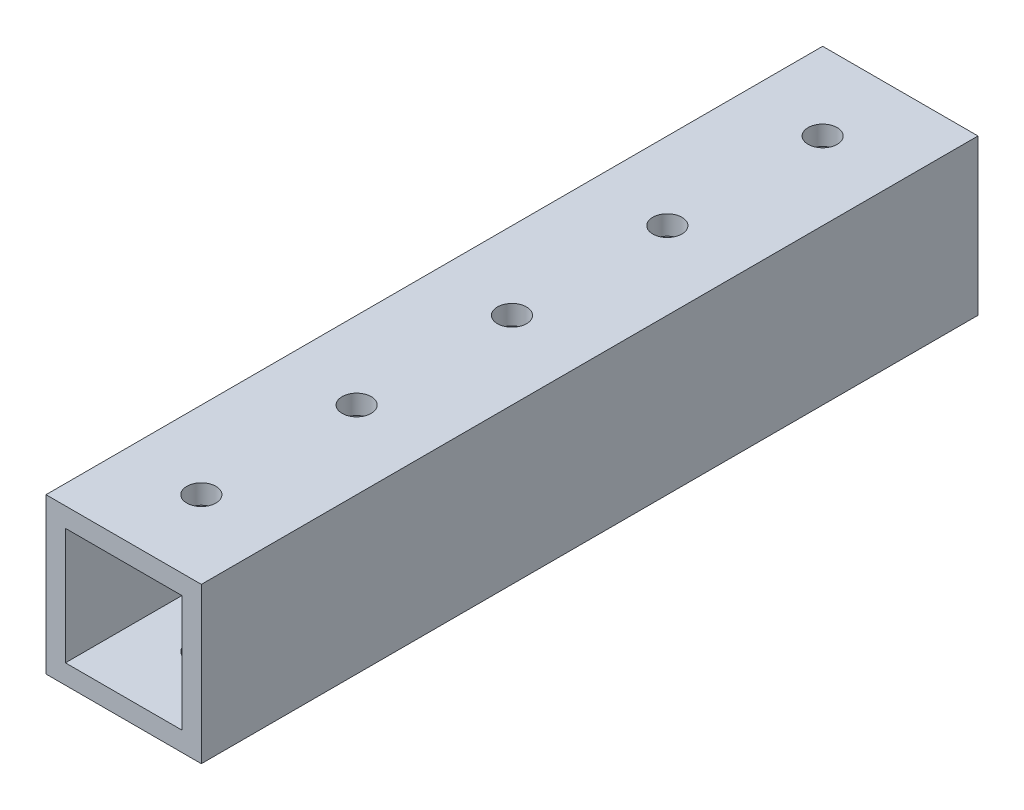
ISO-10303-21;
HEADER;
FILE_DESCRIPTION(('STEP AP214'),'2;1');
FILE_NAME('part.step','',(''),(''),'','','');
FILE_SCHEMA(('AUTOMOTIVE_DESIGN { 1 0 10303 214 1 1 1 1 }'));
ENDSEC;
DATA;
#1=APPLICATION_CONTEXT('core data for automotive mechanical design processes');
#2=APPLICATION_PROTOCOL_DEFINITION('international standard','automotive_design',2000,#1);
#3=PRODUCT_CONTEXT('',#1,'mechanical');
#4=PRODUCT('Part','Part','',(#3));
#5=PRODUCT_RELATED_PRODUCT_CATEGORY('part','',(#4));
#6=PRODUCT_DEFINITION_FORMATION('','',#4);
#7=PRODUCT_DEFINITION_CONTEXT('part definition',#1,'design');
#8=PRODUCT_DEFINITION('design','',#6,#7);
#9=PRODUCT_DEFINITION_SHAPE('','',#8);
#10=(LENGTH_UNIT() NAMED_UNIT(*) SI_UNIT(.MILLI.,.METRE.));
#11=(NAMED_UNIT(*) PLANE_ANGLE_UNIT() SI_UNIT($,.RADIAN.));
#12=(NAMED_UNIT(*) SI_UNIT($,.STERADIAN.) SOLID_ANGLE_UNIT());
#13=UNCERTAINTY_MEASURE_WITH_UNIT(LENGTH_MEASURE(1.E-05),#10,'distance_accuracy_value','');
#14=(GEOMETRIC_REPRESENTATION_CONTEXT(3) GLOBAL_UNCERTAINTY_ASSIGNED_CONTEXT((#13)) GLOBAL_UNIT_ASSIGNED_CONTEXT((#10,
#11,#12)) REPRESENTATION_CONTEXT('',''));
#15=CARTESIAN_POINT('',(0.,0.,0.));
#16=DIRECTION('',(0.,0.,1.));
#17=DIRECTION('',(1.,0.,0.));
#18=AXIS2_PLACEMENT_3D('',#15,#16,#17);
#19=CARTESIAN_POINT('',(-12.7,12.7,63.5));
#20=DIRECTION('',(0.,1.,0.));
#21=DIRECTION('',(0.,0.,1.));
#22=AXIS2_PLACEMENT_3D('',#19,#20,#21);
#23=PLANE('',#22);
#24=CARTESIAN_POINT('',(0.,12.7,50.8));
#25=DIRECTION('',(0.,1.,0.));
#26=DIRECTION('',(0.,0.,1.));
#27=AXIS2_PLACEMENT_3D('',#24,#25,#26);
#28=CIRCLE('',#27,2.38125);
#29=CARTESIAN_POINT('',(0.,12.7,53.18125));
#30=VERTEX_POINT('',#29);
#31=EDGE_CURVE('E322',#30,#30,#28,.T.);
#32=ORIENTED_EDGE('',*,*,#31,.F.);
#33=EDGE_LOOP('',(#32));
#34=FACE_BOUND('',#33,.T.);
#35=CARTESIAN_POINT('',(0.,12.7,25.4));
#36=DIRECTION('',(0.,1.,0.));
#37=DIRECTION('',(0.,0.,1.));
#38=AXIS2_PLACEMENT_3D('',#35,#36,#37);
#39=CIRCLE('',#38,2.38125);
#40=CARTESIAN_POINT('',(0.,12.7,27.78125));
#41=VERTEX_POINT('',#40);
#42=EDGE_CURVE('E209',#41,#41,#39,.T.);
#43=ORIENTED_EDGE('',*,*,#42,.F.);
#44=EDGE_LOOP('',(#43));
#45=FACE_BOUND('',#44,.T.);
#46=CARTESIAN_POINT('',(0.,12.7,0.));
#47=DIRECTION('',(0.,1.,0.));
#48=DIRECTION('',(0.,0.,1.));
#49=AXIS2_PLACEMENT_3D('',#46,#47,#48);
#50=CIRCLE('',#49,2.38125);
#51=CARTESIAN_POINT('',(0.,12.7,2.38125));
#52=VERTEX_POINT('',#51);
#53=EDGE_CURVE('E206',#52,#52,#50,.T.);
#54=ORIENTED_EDGE('',*,*,#53,.F.);
#55=EDGE_LOOP('',(#54));
#56=FACE_BOUND('',#55,.T.);
#57=CARTESIAN_POINT('',(0.,12.7,-25.4));
#58=DIRECTION('',(0.,1.,0.));
#59=DIRECTION('',(0.,0.,1.));
#60=AXIS2_PLACEMENT_3D('',#57,#58,#59);
#61=CIRCLE('',#60,2.38125);
#62=CARTESIAN_POINT('',(0.,12.7,-23.01875));
#63=VERTEX_POINT('',#62);
#64=EDGE_CURVE('E225',#63,#63,#61,.T.);
#65=ORIENTED_EDGE('',*,*,#64,.F.);
#66=EDGE_LOOP('',(#65));
#67=FACE_BOUND('',#66,.T.);
#68=CARTESIAN_POINT('',(0.,12.7,-50.8));
#69=DIRECTION('',(0.,1.,0.));
#70=DIRECTION('',(0.,0.,1.));
#71=AXIS2_PLACEMENT_3D('',#68,#69,#70);
#72=CIRCLE('',#71,2.38125);
#73=CARTESIAN_POINT('',(0.,12.7,-48.41875));
#74=VERTEX_POINT('',#73);
#75=EDGE_CURVE('E232',#74,#74,#72,.T.);
#76=ORIENTED_EDGE('',*,*,#75,.F.);
#77=EDGE_LOOP('',(#76));
#78=FACE_BOUND('',#77,.T.);
#79=DIRECTION('',(1.,0.,0.));
#80=VECTOR('',#79,1.);
#81=CARTESIAN_POINT('',(-12.7,12.7,-63.5));
#82=LINE('',#81,#80);
#83=CARTESIAN_POINT('',(-12.7,12.7,-63.5));
#84=VERTEX_POINT('',#83);
#85=CARTESIAN_POINT('',(12.7,12.7,-63.5));
#86=VERTEX_POINT('',#85);
#87=EDGE_CURVE('E156',#84,#86,#82,.T.);
#88=ORIENTED_EDGE('',*,*,#87,.F.);
#89=DIRECTION('',(0.,0.,-1.));
#90=VECTOR('',#89,1.);
#91=CARTESIAN_POINT('',(-12.7,12.7,63.5));
#92=LINE('',#91,#90);
#93=CARTESIAN_POINT('',(-12.7,12.7,63.5));
#94=VERTEX_POINT('',#93);
#95=EDGE_CURVE('E12',#94,#84,#92,.T.);
#96=ORIENTED_EDGE('',*,*,#95,.F.);
#97=DIRECTION('',(1.,0.,0.));
#98=VECTOR('',#97,1.);
#99=CARTESIAN_POINT('',(-12.7,12.7,63.5));
#100=LINE('',#99,#98);
#101=CARTESIAN_POINT('',(12.7,12.7,63.5));
#102=VERTEX_POINT('',#101);
#103=EDGE_CURVE('E160',#94,#102,#100,.T.);
#104=ORIENTED_EDGE('',*,*,#103,.T.);
#105=DIRECTION('',(0.,0.,-1.));
#106=VECTOR('',#105,1.);
#107=CARTESIAN_POINT('',(12.7,12.7,63.5));
#108=LINE('',#107,#106);
#109=EDGE_CURVE('E171',#102,#86,#108,.T.);
#110=ORIENTED_EDGE('',*,*,#109,.T.);
#111=EDGE_LOOP('',(#88,#96,#104,#110));
#112=FACE_BOUND('',#111,.T.);
#113=ADVANCED_FACE('F57',(#34,#45,#56,#67,#78,#112),#23,.T.);
#114=CARTESIAN_POINT('',(-12.7,12.7,63.5));
#115=DIRECTION('',(1.,0.,0.));
#116=DIRECTION('',(0.,1.,0.));
#117=AXIS2_PLACEMENT_3D('',#114,#115,#116);
#118=PLANE('',#117);
#119=DIRECTION('',(0.,-1.,0.));
#120=VECTOR('',#119,1.);
#121=CARTESIAN_POINT('',(-12.7,12.7,-63.5));
#122=LINE('',#121,#120);
#123=CARTESIAN_POINT('',(-12.7,-12.7,-63.5));
#124=VERTEX_POINT('',#123);
#125=EDGE_CURVE('E164',#84,#124,#122,.T.);
#126=ORIENTED_EDGE('',*,*,#125,.T.);
#127=DIRECTION('',(0.,0.,-1.));
#128=VECTOR('',#127,1.);
#129=CARTESIAN_POINT('',(-12.7,-12.7,63.5));
#130=LINE('',#129,#128);
#131=CARTESIAN_POINT('',(-12.7,-12.7,63.5));
#132=VERTEX_POINT('',#131);
#133=EDGE_CURVE('E65',#132,#124,#130,.T.);
#134=ORIENTED_EDGE('',*,*,#133,.F.);
#135=DIRECTION('',(0.,-1.,0.));
#136=VECTOR('',#135,1.);
#137=CARTESIAN_POINT('',(-12.7,12.7,63.5));
#138=LINE('',#137,#136);
#139=EDGE_CURVE('E169',#94,#132,#138,.T.);
#140=ORIENTED_EDGE('',*,*,#139,.F.);
#141=ORIENTED_EDGE('',*,*,#95,.T.);
#142=EDGE_LOOP('',(#126,#134,#140,#141));
#143=FACE_BOUND('',#142,.T.);
#144=ADVANCED_FACE('F242',(#143),#118,.F.);
#145=CARTESIAN_POINT('',(-12.7,-12.7,63.5));
#146=DIRECTION('',(0.,1.,0.));
#147=DIRECTION('',(0.,0.,1.));
#148=AXIS2_PLACEMENT_3D('',#145,#146,#147);
#149=PLANE('',#148);
#150=CARTESIAN_POINT('',(0.,-12.7,50.8));
#151=DIRECTION('',(0.,1.,0.));
#152=DIRECTION('',(0.,0.,1.));
#153=AXIS2_PLACEMENT_3D('',#150,#151,#152);
#154=CIRCLE('',#153,2.38125);
#155=CARTESIAN_POINT('',(0.,-12.7,53.18125));
#156=VERTEX_POINT('',#155);
#157=EDGE_CURVE('E321',#156,#156,#154,.T.);
#158=ORIENTED_EDGE('',*,*,#157,.T.);
#159=EDGE_LOOP('',(#158));
#160=FACE_BOUND('',#159,.T.);
#161=CARTESIAN_POINT('',(0.,-12.7,25.4));
#162=DIRECTION('',(0.,1.,0.));
#163=DIRECTION('',(0.,0.,1.));
#164=AXIS2_PLACEMENT_3D('',#161,#162,#163);
#165=CIRCLE('',#164,2.38125);
#166=CARTESIAN_POINT('',(0.,-12.7,27.78125));
#167=VERTEX_POINT('',#166);
#168=EDGE_CURVE('E202',#167,#167,#165,.T.);
#169=ORIENTED_EDGE('',*,*,#168,.T.);
#170=EDGE_LOOP('',(#169));
#171=FACE_BOUND('',#170,.T.);
#172=CARTESIAN_POINT('',(0.,-12.7,0.));
#173=DIRECTION('',(0.,1.,0.));
#174=DIRECTION('',(0.,0.,1.));
#175=AXIS2_PLACEMENT_3D('',#172,#173,#174);
#176=CIRCLE('',#175,2.38125);
#177=CARTESIAN_POINT('',(0.,-12.7,2.38125));
#178=VERTEX_POINT('',#177);
#179=EDGE_CURVE('E198',#178,#178,#176,.T.);
#180=ORIENTED_EDGE('',*,*,#179,.T.);
#181=EDGE_LOOP('',(#180));
#182=FACE_BOUND('',#181,.T.);
#183=CARTESIAN_POINT('',(0.,-12.7,-25.4));
#184=DIRECTION('',(0.,1.,0.));
#185=DIRECTION('',(0.,0.,1.));
#186=AXIS2_PLACEMENT_3D('',#183,#184,#185);
#187=CIRCLE('',#186,2.38125);
#188=CARTESIAN_POINT('',(0.,-12.7,-23.01875));
#189=VERTEX_POINT('',#188);
#190=EDGE_CURVE('E194',#189,#189,#187,.T.);
#191=ORIENTED_EDGE('',*,*,#190,.T.);
#192=EDGE_LOOP('',(#191));
#193=FACE_BOUND('',#192,.T.);
#194=CARTESIAN_POINT('',(0.,-12.7,-50.8));
#195=DIRECTION('',(0.,1.,0.));
#196=DIRECTION('',(0.,0.,1.));
#197=AXIS2_PLACEMENT_3D('',#194,#195,#196);
#198=CIRCLE('',#197,2.38125);
#199=CARTESIAN_POINT('',(0.,-12.7,-48.41875));
#200=VERTEX_POINT('',#199);
#201=EDGE_CURVE('E189',#200,#200,#198,.T.);
#202=ORIENTED_EDGE('',*,*,#201,.T.);
#203=EDGE_LOOP('',(#202));
#204=FACE_BOUND('',#203,.T.);
#205=DIRECTION('',(1.,0.,0.));
#206=VECTOR('',#205,1.);
#207=CARTESIAN_POINT('',(-12.7,-12.7,-63.5));
#208=LINE('',#207,#206);
#209=CARTESIAN_POINT('',(12.7,-12.7,-63.5));
#210=VERTEX_POINT('',#209);
#211=EDGE_CURVE('E177',#124,#210,#208,.T.);
#212=ORIENTED_EDGE('',*,*,#211,.T.);
#213=DIRECTION('',(0.,0.,-1.));
#214=VECTOR('',#213,1.);
#215=CARTESIAN_POINT('',(12.7,-12.7,63.5));
#216=LINE('',#215,#214);
#217=CARTESIAN_POINT('',(12.7,-12.7,63.5));
#218=VERTEX_POINT('',#217);
#219=EDGE_CURVE('E183',#218,#210,#216,.T.);
#220=ORIENTED_EDGE('',*,*,#219,.F.);
#221=DIRECTION('',(1.,0.,0.));
#222=VECTOR('',#221,1.);
#223=CARTESIAN_POINT('',(-12.7,-12.7,63.5));
#224=LINE('',#223,#222);
#225=EDGE_CURVE('E167',#132,#218,#224,.T.);
#226=ORIENTED_EDGE('',*,*,#225,.F.);
#227=ORIENTED_EDGE('',*,*,#133,.T.);
#228=EDGE_LOOP('',(#212,#220,#226,#227));
#229=FACE_BOUND('',#228,.T.);
#230=ADVANCED_FACE('F255',(#160,#171,#182,#193,#204,#229),#149,.F.);
#231=CARTESIAN_POINT('',(12.7,12.7,63.5));
#232=DIRECTION('',(1.,0.,0.));
#233=DIRECTION('',(0.,1.,0.));
#234=AXIS2_PLACEMENT_3D('',#231,#232,#233);
#235=PLANE('',#234);
#236=DIRECTION('',(0.,-1.,0.));
#237=VECTOR('',#236,1.);
#238=CARTESIAN_POINT('',(12.7,12.7,-63.5));
#239=LINE('',#238,#237);
#240=EDGE_CURVE('E174',#86,#210,#239,.T.);
#241=ORIENTED_EDGE('',*,*,#240,.F.);
#242=ORIENTED_EDGE('',*,*,#109,.F.);
#243=DIRECTION('',(0.,-1.,0.));
#244=VECTOR('',#243,1.);
#245=CARTESIAN_POINT('',(12.7,12.7,63.5));
#246=LINE('',#245,#244);
#247=EDGE_CURVE('E163',#102,#218,#246,.T.);
#248=ORIENTED_EDGE('',*,*,#247,.T.);
#249=ORIENTED_EDGE('',*,*,#219,.T.);
#250=EDGE_LOOP('',(#241,#242,#248,#249));
#251=FACE_BOUND('',#250,.T.);
#252=ADVANCED_FACE('F260',(#251),#235,.T.);
#253=CARTESIAN_POINT('',(0.,0.,63.5));
#254=DIRECTION('',(0.,0.,-1.));
#255=DIRECTION('',(-1.,0.,0.));
#256=AXIS2_PLACEMENT_3D('',#253,#254,#255);
#257=PLANE('',#256);
#258=DIRECTION('',(0.,-1.,0.));
#259=VECTOR('',#258,1.);
#260=CARTESIAN_POINT('',(-9.525,9.525,63.5));
#261=LINE('',#260,#259);
#262=CARTESIAN_POINT('',(-9.525,9.525,63.5));
#263=VERTEX_POINT('',#262);
#264=CARTESIAN_POINT('',(-9.52499999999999,-9.525,63.5));
#265=VERTEX_POINT('',#264);
#266=EDGE_CURVE('E127',#263,#265,#261,.T.);
#267=ORIENTED_EDGE('',*,*,#266,.F.);
#268=DIRECTION('',(1.,0.,0.));
#269=VECTOR('',#268,1.);
#270=CARTESIAN_POINT('',(-9.525,9.525,63.5));
#271=LINE('',#270,#269);
#272=CARTESIAN_POINT('',(9.52499999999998,9.525,63.5));
#273=VERTEX_POINT('',#272);
#274=EDGE_CURVE('E124',#263,#273,#271,.T.);
#275=ORIENTED_EDGE('',*,*,#274,.T.);
#276=DIRECTION('',(0.,-1.,0.));
#277=VECTOR('',#276,1.);
#278=CARTESIAN_POINT('',(9.52499999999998,9.525,63.5));
#279=LINE('',#278,#277);
#280=CARTESIAN_POINT('',(9.52499999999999,-9.52500000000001,63.5));
#281=VERTEX_POINT('',#280);
#282=EDGE_CURVE('E130',#273,#281,#279,.T.);
#283=ORIENTED_EDGE('',*,*,#282,.T.);
#284=DIRECTION('',(1.,0.,0.));
#285=VECTOR('',#284,1.);
#286=CARTESIAN_POINT('',(-9.52499999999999,-9.525,63.5));
#287=LINE('',#286,#285);
#288=EDGE_CURVE('E134',#265,#281,#287,.T.);
#289=ORIENTED_EDGE('',*,*,#288,.F.);
#290=EDGE_LOOP('',(#267,#275,#283,#289));
#291=FACE_BOUND('',#290,.T.);
#292=ORIENTED_EDGE('',*,*,#103,.F.);
#293=ORIENTED_EDGE('',*,*,#139,.T.);
#294=ORIENTED_EDGE('',*,*,#225,.T.);
#295=ORIENTED_EDGE('',*,*,#247,.F.);
#296=EDGE_LOOP('',(#292,#293,#294,#295));
#297=FACE_BOUND('',#296,.T.);
#298=ADVANCED_FACE('F136',(#291,#297),#257,.F.);
#299=CARTESIAN_POINT('',(0.,0.,-63.5));
#300=DIRECTION('',(0.,0.,-1.));
#301=DIRECTION('',(-1.,0.,0.));
#302=AXIS2_PLACEMENT_3D('',#299,#300,#301);
#303=PLANE('',#302);
#304=DIRECTION('',(1.,0.,0.));
#305=VECTOR('',#304,1.);
#306=CARTESIAN_POINT('',(-9.525,9.525,-63.5));
#307=LINE('',#306,#305);
#308=CARTESIAN_POINT('',(-9.525,9.525,-63.5));
#309=VERTEX_POINT('',#308);
#310=CARTESIAN_POINT('',(9.52499999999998,9.525,-63.5));
#311=VERTEX_POINT('',#310);
#312=EDGE_CURVE('E81',#309,#311,#307,.T.);
#313=ORIENTED_EDGE('',*,*,#312,.F.);
#314=DIRECTION('',(0.,-1.,0.));
#315=VECTOR('',#314,1.);
#316=CARTESIAN_POINT('',(-9.525,9.525,-63.5));
#317=LINE('',#316,#315);
#318=CARTESIAN_POINT('',(-9.52499999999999,-9.525,-63.5));
#319=VERTEX_POINT('',#318);
#320=EDGE_CURVE('E138',#309,#319,#317,.T.);
#321=ORIENTED_EDGE('',*,*,#320,.T.);
#322=DIRECTION('',(1.,0.,0.));
#323=VECTOR('',#322,1.);
#324=CARTESIAN_POINT('',(-9.52499999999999,-9.525,-63.5));
#325=LINE('',#324,#323);
#326=CARTESIAN_POINT('',(9.52499999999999,-9.52500000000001,-63.5));
#327=VERTEX_POINT('',#326);
#328=EDGE_CURVE('E141',#319,#327,#325,.T.);
#329=ORIENTED_EDGE('',*,*,#328,.T.);
#330=DIRECTION('',(0.,-1.,0.));
#331=VECTOR('',#330,1.);
#332=CARTESIAN_POINT('',(9.52499999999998,9.525,-63.5));
#333=LINE('',#332,#331);
#334=EDGE_CURVE('E150',#311,#327,#333,.T.);
#335=ORIENTED_EDGE('',*,*,#334,.F.);
#336=EDGE_LOOP('',(#313,#321,#329,#335));
#337=FACE_BOUND('',#336,.T.);
#338=ORIENTED_EDGE('',*,*,#87,.T.);
#339=ORIENTED_EDGE('',*,*,#240,.T.);
#340=ORIENTED_EDGE('',*,*,#211,.F.);
#341=ORIENTED_EDGE('',*,*,#125,.F.);
#342=EDGE_LOOP('',(#338,#339,#340,#341));
#343=FACE_BOUND('',#342,.T.);
#344=ADVANCED_FACE('F249',(#337,#343),#303,.T.);
#345=CARTESIAN_POINT('',(-9.525,9.525,63.5));
#346=DIRECTION('',(0.,1.,0.));
#347=DIRECTION('',(0.,0.,1.));
#348=AXIS2_PLACEMENT_3D('',#345,#346,#347);
#349=PLANE('',#348);
#350=CARTESIAN_POINT('',(0.,9.525,50.8));
#351=DIRECTION('',(0.,1.,0.));
#352=DIRECTION('',(0.,0.,1.));
#353=AXIS2_PLACEMENT_3D('',#350,#351,#352);
#354=CIRCLE('',#353,2.38125);
#355=CARTESIAN_POINT('',(0.,9.525,53.18125));
#356=VERTEX_POINT('',#355);
#357=EDGE_CURVE('E214',#356,#356,#354,.T.);
#358=ORIENTED_EDGE('',*,*,#357,.T.);
#359=EDGE_LOOP('',(#358));
#360=FACE_BOUND('',#359,.T.);
#361=CARTESIAN_POINT('',(0.,9.525,25.4));
#362=DIRECTION('',(0.,1.,0.));
#363=DIRECTION('',(0.,0.,1.));
#364=AXIS2_PLACEMENT_3D('',#361,#362,#363);
#365=CIRCLE('',#364,2.38125);
#366=CARTESIAN_POINT('',(0.,9.525,27.78125));
#367=VERTEX_POINT('',#366);
#368=EDGE_CURVE('E201',#367,#367,#365,.T.);
#369=ORIENTED_EDGE('',*,*,#368,.T.);
#370=EDGE_LOOP('',(#369));
#371=FACE_BOUND('',#370,.T.);
#372=CARTESIAN_POINT('',(0.,9.525,0.));
#373=DIRECTION('',(0.,1.,0.));
#374=DIRECTION('',(0.,0.,1.));
#375=AXIS2_PLACEMENT_3D('',#372,#373,#374);
#376=CIRCLE('',#375,2.38125);
#377=CARTESIAN_POINT('',(0.,9.525,2.38125));
#378=VERTEX_POINT('',#377);
#379=EDGE_CURVE('E197',#378,#378,#376,.T.);
#380=ORIENTED_EDGE('',*,*,#379,.T.);
#381=EDGE_LOOP('',(#380));
#382=FACE_BOUND('',#381,.T.);
#383=CARTESIAN_POINT('',(0.,9.525,-25.4));
#384=DIRECTION('',(0.,1.,0.));
#385=DIRECTION('',(0.,0.,1.));
#386=AXIS2_PLACEMENT_3D('',#383,#384,#385);
#387=CIRCLE('',#386,2.38125);
#388=CARTESIAN_POINT('',(0.,9.525,-23.01875));
#389=VERTEX_POINT('',#388);
#390=EDGE_CURVE('E193',#389,#389,#387,.T.);
#391=ORIENTED_EDGE('',*,*,#390,.T.);
#392=EDGE_LOOP('',(#391));
#393=FACE_BOUND('',#392,.T.);
#394=CARTESIAN_POINT('',(0.,9.525,-50.8));
#395=DIRECTION('',(0.,1.,0.));
#396=DIRECTION('',(0.,0.,1.));
#397=AXIS2_PLACEMENT_3D('',#394,#395,#396);
#398=CIRCLE('',#397,2.38125);
#399=CARTESIAN_POINT('',(0.,9.525,-48.41875));
#400=VERTEX_POINT('',#399);
#401=EDGE_CURVE('E144',#400,#400,#398,.T.);
#402=ORIENTED_EDGE('',*,*,#401,.T.);
#403=EDGE_LOOP('',(#402));
#404=FACE_BOUND('',#403,.T.);
#405=ORIENTED_EDGE('',*,*,#312,.T.);
#406=DIRECTION('',(0.,0.,-1.));
#407=VECTOR('',#406,1.);
#408=CARTESIAN_POINT('',(9.52499999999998,9.525,63.5));
#409=LINE('',#408,#407);
#410=EDGE_CURVE('E121',#273,#311,#409,.T.);
#411=ORIENTED_EDGE('',*,*,#410,.F.);
#412=ORIENTED_EDGE('',*,*,#274,.F.);
#413=DIRECTION('',(0.,0.,-1.));
#414=VECTOR('',#413,1.);
#415=CARTESIAN_POINT('',(-9.525,9.525,63.5));
#416=LINE('',#415,#414);
#417=EDGE_CURVE('E154',#263,#309,#416,.T.);
#418=ORIENTED_EDGE('',*,*,#417,.T.);
#419=EDGE_LOOP('',(#405,#411,#412,#418));
#420=FACE_BOUND('',#419,.T.);
#421=ADVANCED_FACE('F122',(#360,#371,#382,#393,#404,#420),#349,.F.);
#422=CARTESIAN_POINT('',(-9.525,9.525,63.5));
#423=DIRECTION('',(1.,0.,0.));
#424=DIRECTION('',(0.,1.,0.));
#425=AXIS2_PLACEMENT_3D('',#422,#423,#424);
#426=PLANE('',#425);
#427=ORIENTED_EDGE('',*,*,#320,.F.);
#428=ORIENTED_EDGE('',*,*,#417,.F.);
#429=ORIENTED_EDGE('',*,*,#266,.T.);
#430=DIRECTION('',(0.,0.,-1.));
#431=VECTOR('',#430,1.);
#432=CARTESIAN_POINT('',(-9.52499999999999,-9.525,63.5));
#433=LINE('',#432,#431);
#434=EDGE_CURVE('E157',#265,#319,#433,.T.);
#435=ORIENTED_EDGE('',*,*,#434,.T.);
#436=EDGE_LOOP('',(#427,#428,#429,#435));
#437=FACE_BOUND('',#436,.T.);
#438=ADVANCED_FACE('F277',(#437),#426,.T.);
#439=CARTESIAN_POINT('',(-9.52499999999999,-9.525,63.5));
#440=DIRECTION('',(0.,1.,0.));
#441=DIRECTION('',(-1.,0.,0.));
#442=AXIS2_PLACEMENT_3D('',#439,#440,#441);
#443=PLANE('',#442);
#444=CARTESIAN_POINT('',(0.,-9.525,50.8));
#445=DIRECTION('',(0.,1.,0.));
#446=DIRECTION('',(-1.,0.,0.));
#447=AXIS2_PLACEMENT_3D('',#444,#445,#446);
#448=CIRCLE('',#447,2.38125);
#449=CARTESIAN_POINT('',(-2.38124999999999,-9.525,50.8));
#450=VERTEX_POINT('',#449);
#451=EDGE_CURVE('E60',#450,#450,#448,.T.);
#452=ORIENTED_EDGE('',*,*,#451,.F.);
#453=EDGE_LOOP('',(#452));
#454=FACE_BOUND('',#453,.T.);
#455=CARTESIAN_POINT('',(0.,-9.525,25.4));
#456=DIRECTION('',(0.,1.,0.));
#457=DIRECTION('',(-1.,0.,0.));
#458=AXIS2_PLACEMENT_3D('',#455,#456,#457);
#459=CIRCLE('',#458,2.38125);
#460=CARTESIAN_POINT('',(-2.38124999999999,-9.525,25.4));
#461=VERTEX_POINT('',#460);
#462=EDGE_CURVE('E199',#461,#461,#459,.T.);
#463=ORIENTED_EDGE('',*,*,#462,.F.);
#464=EDGE_LOOP('',(#463));
#465=FACE_BOUND('',#464,.T.);
#466=CARTESIAN_POINT('',(0.,-9.525,0.));
#467=DIRECTION('',(0.,1.,0.));
#468=DIRECTION('',(-1.,0.,0.));
#469=AXIS2_PLACEMENT_3D('',#466,#467,#468);
#470=CIRCLE('',#469,2.38125);
#471=CARTESIAN_POINT('',(-2.38124999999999,-9.525,0.));
#472=VERTEX_POINT('',#471);
#473=EDGE_CURVE('E195',#472,#472,#470,.T.);
#474=ORIENTED_EDGE('',*,*,#473,.F.);
#475=EDGE_LOOP('',(#474));
#476=FACE_BOUND('',#475,.T.);
#477=CARTESIAN_POINT('',(0.,-9.525,-25.4));
#478=DIRECTION('',(0.,1.,0.));
#479=DIRECTION('',(-1.,0.,0.));
#480=AXIS2_PLACEMENT_3D('',#477,#478,#479);
#481=CIRCLE('',#480,2.38125);
#482=CARTESIAN_POINT('',(-2.38124999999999,-9.525,-25.4));
#483=VERTEX_POINT('',#482);
#484=EDGE_CURVE('E190',#483,#483,#481,.T.);
#485=ORIENTED_EDGE('',*,*,#484,.F.);
#486=EDGE_LOOP('',(#485));
#487=FACE_BOUND('',#486,.T.);
#488=CARTESIAN_POINT('',(0.,-9.525,-50.8));
#489=DIRECTION('',(0.,1.,0.));
#490=DIRECTION('',(-1.,0.,0.));
#491=AXIS2_PLACEMENT_3D('',#488,#489,#490);
#492=CIRCLE('',#491,2.38125);
#493=CARTESIAN_POINT('',(-2.38124999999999,-9.525,-50.8));
#494=VERTEX_POINT('',#493);
#495=EDGE_CURVE('E186',#494,#494,#492,.T.);
#496=ORIENTED_EDGE('',*,*,#495,.F.);
#497=EDGE_LOOP('',(#496));
#498=FACE_BOUND('',#497,.T.);
#499=ORIENTED_EDGE('',*,*,#328,.F.);
#500=ORIENTED_EDGE('',*,*,#434,.F.);
#501=ORIENTED_EDGE('',*,*,#288,.T.);
#502=DIRECTION('',(0.,0.,-1.));
#503=VECTOR('',#502,1.);
#504=CARTESIAN_POINT('',(9.52499999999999,-9.52500000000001,63.5));
#505=LINE('',#504,#503);
#506=EDGE_CURVE('E73',#281,#327,#505,.T.);
#507=ORIENTED_EDGE('',*,*,#506,.T.);
#508=EDGE_LOOP('',(#499,#500,#501,#507));
#509=FACE_BOUND('',#508,.T.);
#510=ADVANCED_FACE('F282',(#454,#465,#476,#487,#498,#509),#443,.T.);
#511=CARTESIAN_POINT('',(9.52499999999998,9.525,63.5));
#512=DIRECTION('',(1.,0.,0.));
#513=DIRECTION('',(0.,1.,0.));
#514=AXIS2_PLACEMENT_3D('',#511,#512,#513);
#515=PLANE('',#514);
#516=ORIENTED_EDGE('',*,*,#334,.T.);
#517=ORIENTED_EDGE('',*,*,#506,.F.);
#518=ORIENTED_EDGE('',*,*,#282,.F.);
#519=ORIENTED_EDGE('',*,*,#410,.T.);
#520=EDGE_LOOP('',(#516,#517,#518,#519));
#521=FACE_BOUND('',#520,.T.);
#522=ADVANCED_FACE('F131',(#521),#515,.F.);
#523=CARTESIAN_POINT('',(0.,-12.7,-50.8));
#524=DIRECTION('',(0.,1.,0.));
#525=DIRECTION('',(0.,0.,1.));
#526=AXIS2_PLACEMENT_3D('',#523,#524,#525);
#527=CYLINDRICAL_SURFACE('',#526,2.38125);
#528=ORIENTED_EDGE('',*,*,#495,.T.);
#529=EDGE_LOOP('',(#528));
#530=FACE_BOUND('',#529,.T.);
#531=ORIENTED_EDGE('',*,*,#201,.F.);
#532=EDGE_LOOP('',(#531));
#533=FACE_BOUND('',#532,.T.);
#534=ADVANCED_FACE('F281',(#530,#533),#527,.F.);
#535=ORIENTED_EDGE('',*,*,#75,.T.);
#536=EDGE_LOOP('',(#535));
#537=FACE_BOUND('',#536,.T.);
#538=ORIENTED_EDGE('',*,*,#401,.F.);
#539=EDGE_LOOP('',(#538));
#540=FACE_BOUND('',#539,.T.);
#541=ADVANCED_FACE('F237',(#537,#540),#527,.F.);
#542=CARTESIAN_POINT('',(0.,-12.7,-25.4));
#543=DIRECTION('',(0.,1.,0.));
#544=DIRECTION('',(0.,0.,1.));
#545=AXIS2_PLACEMENT_3D('',#542,#543,#544);
#546=CYLINDRICAL_SURFACE('',#545,2.38125);
#547=ORIENTED_EDGE('',*,*,#484,.T.);
#548=EDGE_LOOP('',(#547));
#549=FACE_BOUND('',#548,.T.);
#550=ORIENTED_EDGE('',*,*,#190,.F.);
#551=EDGE_LOOP('',(#550));
#552=FACE_BOUND('',#551,.T.);
#553=ADVANCED_FACE('F292',(#549,#552),#546,.F.);
#554=ORIENTED_EDGE('',*,*,#64,.T.);
#555=EDGE_LOOP('',(#554));
#556=FACE_BOUND('',#555,.T.);
#557=ORIENTED_EDGE('',*,*,#390,.F.);
#558=EDGE_LOOP('',(#557));
#559=FACE_BOUND('',#558,.T.);
#560=ADVANCED_FACE('F295',(#556,#559),#546,.F.);
#561=CARTESIAN_POINT('',(0.,-12.7,0.));
#562=DIRECTION('',(0.,1.,0.));
#563=DIRECTION('',(0.,0.,1.));
#564=AXIS2_PLACEMENT_3D('',#561,#562,#563);
#565=CYLINDRICAL_SURFACE('',#564,2.38125);
#566=ORIENTED_EDGE('',*,*,#473,.T.);
#567=EDGE_LOOP('',(#566));
#568=FACE_BOUND('',#567,.T.);
#569=ORIENTED_EDGE('',*,*,#179,.F.);
#570=EDGE_LOOP('',(#569));
#571=FACE_BOUND('',#570,.T.);
#572=ADVANCED_FACE('F297',(#568,#571),#565,.F.);
#573=ORIENTED_EDGE('',*,*,#53,.T.);
#574=EDGE_LOOP('',(#573));
#575=FACE_BOUND('',#574,.T.);
#576=ORIENTED_EDGE('',*,*,#379,.F.);
#577=EDGE_LOOP('',(#576));
#578=FACE_BOUND('',#577,.T.);
#579=ADVANCED_FACE('F300',(#575,#578),#565,.F.);
#580=CARTESIAN_POINT('',(0.,-12.7,25.4));
#581=DIRECTION('',(0.,1.,0.));
#582=DIRECTION('',(0.,0.,1.));
#583=AXIS2_PLACEMENT_3D('',#580,#581,#582);
#584=CYLINDRICAL_SURFACE('',#583,2.38125);
#585=ORIENTED_EDGE('',*,*,#462,.T.);
#586=EDGE_LOOP('',(#585));
#587=FACE_BOUND('',#586,.T.);
#588=ORIENTED_EDGE('',*,*,#168,.F.);
#589=EDGE_LOOP('',(#588));
#590=FACE_BOUND('',#589,.T.);
#591=ADVANCED_FACE('F302',(#587,#590),#584,.F.);
#592=ORIENTED_EDGE('',*,*,#42,.T.);
#593=EDGE_LOOP('',(#592));
#594=FACE_BOUND('',#593,.T.);
#595=ORIENTED_EDGE('',*,*,#368,.F.);
#596=EDGE_LOOP('',(#595));
#597=FACE_BOUND('',#596,.T.);
#598=ADVANCED_FACE('F305',(#594,#597),#584,.F.);
#599=CARTESIAN_POINT('',(0.,-12.7,50.8));
#600=DIRECTION('',(0.,1.,0.));
#601=DIRECTION('',(0.,0.,1.));
#602=AXIS2_PLACEMENT_3D('',#599,#600,#601);
#603=CYLINDRICAL_SURFACE('',#602,2.38125);
#604=ORIENTED_EDGE('',*,*,#451,.T.);
#605=EDGE_LOOP('',(#604));
#606=FACE_BOUND('',#605,.T.);
#607=ORIENTED_EDGE('',*,*,#157,.F.);
#608=EDGE_LOOP('',(#607));
#609=FACE_BOUND('',#608,.T.);
#610=ADVANCED_FACE('F306',(#606,#609),#603,.F.);
#611=ORIENTED_EDGE('',*,*,#31,.T.);
#612=EDGE_LOOP('',(#611));
#613=FACE_BOUND('',#612,.T.);
#614=ORIENTED_EDGE('',*,*,#357,.F.);
#615=EDGE_LOOP('',(#614));
#616=FACE_BOUND('',#615,.T.);
#617=ADVANCED_FACE('F308',(#613,#616),#603,.F.);
#618=CLOSED_SHELL('',(#113,#144,#230,#252,#298,#344,#421,#438,#510,#522,#534,#541,#553,#560,
#572,#579,#591,#598,#610,#617));
#619=MANIFOLD_SOLID_BREP('B2',#618);
#620=ADVANCED_BREP_SHAPE_REPRESENTATION('',(#18,#619),#14);
#621=SHAPE_DEFINITION_REPRESENTATION(#9,#620);
ENDSEC;
END-ISO-10303-21;
